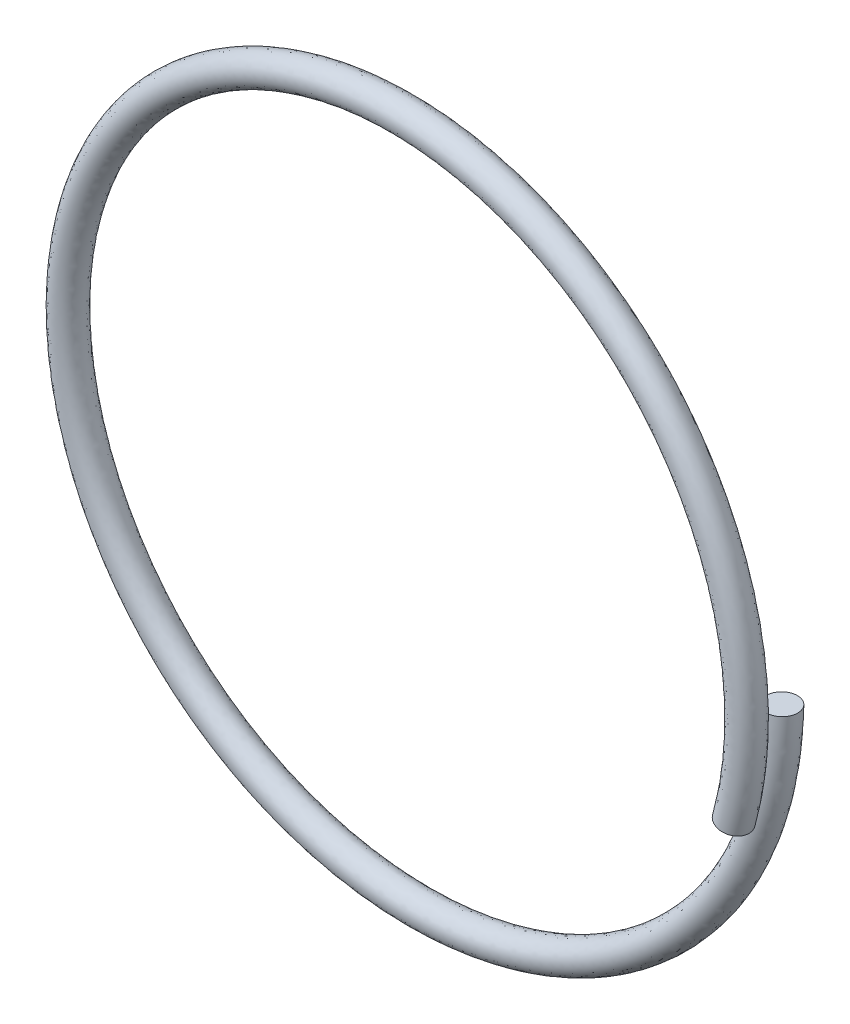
ISO-10303-21;
HEADER;
FILE_DESCRIPTION(('STEP AP214'),'2;1');
FILE_NAME('part.step','',(''),(''),'','','');
FILE_SCHEMA(('AUTOMOTIVE_DESIGN { 1 0 10303 214 1 1 1 1 }'));
ENDSEC;
DATA;
#1=APPLICATION_CONTEXT('core data for automotive mechanical design processes');
#2=APPLICATION_PROTOCOL_DEFINITION('international standard','automotive_design',2000,#1);
#3=PRODUCT_CONTEXT('',#1,'mechanical');
#4=PRODUCT('Part','Part','',(#3));
#5=PRODUCT_RELATED_PRODUCT_CATEGORY('part','',(#4));
#6=PRODUCT_DEFINITION_FORMATION('','',#4);
#7=PRODUCT_DEFINITION_CONTEXT('part definition',#1,'design');
#8=PRODUCT_DEFINITION('design','',#6,#7);
#9=PRODUCT_DEFINITION_SHAPE('','',#8);
#10=(LENGTH_UNIT() NAMED_UNIT(*) SI_UNIT(.MILLI.,.METRE.));
#11=(NAMED_UNIT(*) PLANE_ANGLE_UNIT() SI_UNIT($,.RADIAN.));
#12=(NAMED_UNIT(*) SI_UNIT($,.STERADIAN.) SOLID_ANGLE_UNIT());
#13=UNCERTAINTY_MEASURE_WITH_UNIT(LENGTH_MEASURE(1.E-05),#10,'distance_accuracy_value','');
#14=(GEOMETRIC_REPRESENTATION_CONTEXT(3) GLOBAL_UNCERTAINTY_ASSIGNED_CONTEXT((#13)) GLOBAL_UNIT_ASSIGNED_CONTEXT((#10,
#11,#12)) REPRESENTATION_CONTEXT('',''));
#15=CARTESIAN_POINT('',(0.,0.,0.));
#16=DIRECTION('',(0.,0.,1.));
#17=DIRECTION('',(1.,0.,0.));
#18=AXIS2_PLACEMENT_3D('',#15,#16,#17);
#19=CARTESIAN_POINT('',(7.59634238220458,-1.97941466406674,0.832455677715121));
#20=DIRECTION('',(-0.252121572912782,-0.9675596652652,0.0162174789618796));
#21=DIRECTION('',(0.967686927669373,-0.252154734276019,0.));
#22=AXIS2_PLACEMENT_3D('',#19,#20,#21);
#23=PLANE('',#22);
#24=CARTESIAN_POINT('',(7.59634238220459,-1.97941466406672,0.832455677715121));
#25=DIRECTION('',(-0.25212157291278,-0.967559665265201,0.0162174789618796));
#26=DIRECTION('',(0.967686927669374,-0.252154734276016,0.));
#27=AXIS2_PLACEMENT_3D('',#24,#25,#26);
#28=CIRCLE('',#27,0.349999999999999);
#29=CARTESIAN_POINT('',(7.93503280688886,-2.06766882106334,0.832455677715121));
#30=VERTEX_POINT('',#29);
#31=EDGE_CURVE('E40',#30,#30,#28,.T.);
#32=ORIENTED_EDGE('',*,*,#31,.T.);
#33=EDGE_LOOP('',(#32));
#34=FACE_BOUND('',#33,.T.);
#35=ADVANCED_FACE('F32',(#34),#23,.T.);
#36=CARTESIAN_POINT('',(7.85,0.,0.));
#37=DIRECTION('',(0.,-0.999868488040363,0.0162174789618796));
#38=DIRECTION('',(1.,0.,0.));
#39=AXIS2_PLACEMENT_3D('',#36,#37,#38);
#40=PLANE('',#39);
#41=CARTESIAN_POINT('',(7.85,0.,0.));
#42=DIRECTION('',(0.,-0.999868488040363,0.0162174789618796));
#43=DIRECTION('',(1.,0.,0.));
#44=AXIS2_PLACEMENT_3D('',#41,#42,#43);
#45=CIRCLE('',#44,0.349999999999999);
#46=CARTESIAN_POINT('',(8.19999866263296,1.90033891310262E-05,0.0011848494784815));
#47=VERTEX_POINT('',#46);
#48=EDGE_CURVE('E11',#47,#47,#45,.T.);
#49=ORIENTED_EDGE('',*,*,#48,.F.);
#50=EDGE_LOOP('',(#49));
#51=FACE_BOUND('',#50,.T.);
#52=ADVANCED_FACE('F66',(#51),#40,.F.);
#53=CARTESIAN_POINT('',(7.93503280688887,-2.06766882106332,0.832455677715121));
#54=CARTESIAN_POINT('',(9.12880195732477,2.51362450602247,0.765789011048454));
#55=CARTESIAN_POINT('',(5.75817012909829,5.83810558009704,0.699122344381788));
#56=CARTESIAN_POINT('',(2.38753830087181,9.1625866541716,0.632455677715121));
#57=CARTESIAN_POINT('',(-2.17686267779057,7.90577440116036,0.565789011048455));
#58=CARTESIAN_POINT('',(-6.74126365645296,6.64896214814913,0.499122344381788));
#59=CARTESIAN_POINT('',(-7.93503280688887,2.06766882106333,0.432455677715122));
#60=CARTESIAN_POINT('',(-9.12880195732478,-2.51362450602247,0.365789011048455));
#61=CARTESIAN_POINT('',(-5.7581701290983,-5.83810558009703,0.299122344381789));
#62=CARTESIAN_POINT('',(-2.38753830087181,-9.1625866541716,0.232455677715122));
#63=CARTESIAN_POINT('',(2.17686267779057,-7.90577440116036,0.165789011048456));
#64=CARTESIAN_POINT('',(6.74126365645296,-6.64896214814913,0.099122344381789));
#65=CARTESIAN_POINT('',(7.93503280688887,-2.06766882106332,0.0324556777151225));
#66=CARTESIAN_POINT('',(9.12880195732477,2.51362450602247,-0.034210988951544));
#67=CARTESIAN_POINT('',(5.75817012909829,5.83810558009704,-0.100877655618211));
#68=CARTESIAN_POINT('',(2.38753830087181,9.1625866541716,-0.167544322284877));
#69=CARTESIAN_POINT('',(-2.17686267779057,7.90577440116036,-0.234210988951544));
#70=CARTESIAN_POINT('',(-6.74126365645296,6.64896214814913,-0.30087765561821));
#71=CARTESIAN_POINT('',(-7.93503280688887,2.06766882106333,-0.367544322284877));
#72=CARTESIAN_POINT('',(-9.12880195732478,-2.51362450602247,-0.434210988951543));
#73=CARTESIAN_POINT('',(-5.7581701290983,-5.83810558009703,-0.50087765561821));
#74=CARTESIAN_POINT('',(-2.38753830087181,-9.1625866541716,-0.567544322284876));
#75=CARTESIAN_POINT('',(2.17686267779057,-7.90577440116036,-0.634210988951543));
#76=CARTESIAN_POINT('',(6.74126365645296,-6.64896214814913,-0.700877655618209));
#77=CARTESIAN_POINT('',(7.93503280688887,-2.06766882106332,-0.767544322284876));
#78=CARTESIAN_POINT('',(7.93789532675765,-2.05668341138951,1.53236361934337));
#79=CARTESIAN_POINT('',(9.12532204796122,2.52626259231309,1.46569695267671));
#80=CARTESIAN_POINT('',(5.75008774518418,5.84607729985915,1.39903028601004));
#81=CARTESIAN_POINT('',(2.37485344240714,9.1658920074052,1.33236361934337));
#82=CARTESIAN_POINT('',(-2.18780758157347,7.90276071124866,1.26569695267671));
#83=CARTESIAN_POINT('',(-6.75046860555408,6.63962941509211,1.19903028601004));
#84=CARTESIAN_POINT('',(-7.93789532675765,2.05668341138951,1.13236361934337));
#85=CARTESIAN_POINT('',(-9.12532204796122,-2.52626259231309,1.06569695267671));
#86=CARTESIAN_POINT('',(-5.75008774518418,-5.84607729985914,0.999030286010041));
#87=CARTESIAN_POINT('',(-2.37485344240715,-9.1658920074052,0.932363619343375));
#88=CARTESIAN_POINT('',(2.18780758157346,-7.90276071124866,0.865696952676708));
#89=CARTESIAN_POINT('',(6.75046860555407,-6.63962941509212,0.799030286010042));
#90=CARTESIAN_POINT('',(7.93789532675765,-2.05668341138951,0.732363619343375));
#91=CARTESIAN_POINT('',(9.12532204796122,2.52626259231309,0.665696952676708));
#92=CARTESIAN_POINT('',(5.75008774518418,5.84607729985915,0.599030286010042));
#93=CARTESIAN_POINT('',(2.37485344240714,9.1658920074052,0.532363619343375));
#94=CARTESIAN_POINT('',(-2.18780758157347,7.90276071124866,0.465696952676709));
#95=CARTESIAN_POINT('',(-6.75046860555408,6.63962941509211,0.399030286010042));
#96=CARTESIAN_POINT('',(-7.93789532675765,2.05668341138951,0.332363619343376));
#97=CARTESIAN_POINT('',(-9.12532204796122,-2.52626259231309,0.265696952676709));
#98=CARTESIAN_POINT('',(-5.75008774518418,-5.84607729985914,0.199030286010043));
#99=CARTESIAN_POINT('',(-2.37485344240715,-9.1658920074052,0.132363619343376));
#100=CARTESIAN_POINT('',(2.18780758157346,-7.90276071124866,0.0656969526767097));
#101=CARTESIAN_POINT('',(6.75046860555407,-6.63962941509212,-0.000969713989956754));
#102=CARTESIAN_POINT('',(7.93789532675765,-2.05668341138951,-0.0676363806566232));
#103=CARTESIAN_POINT('',(7.26051447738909,-1.8801750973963,1.53236361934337));
#104=CARTESIAN_POINT('',(8.34603407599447,2.31168489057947,1.46569695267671));
#105=CARTESIAN_POINT('',(5.25853663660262,5.3477024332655,1.39903028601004));
#106=CARTESIAN_POINT('',(2.17103919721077,8.38371997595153,1.33236361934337));
#107=CARTESIAN_POINT('',(-2.00197784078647,7.2278775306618,1.26569695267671));
#108=CARTESIAN_POINT('',(-6.1749948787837,6.07203508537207,1.19903028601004));
#109=CARTESIAN_POINT('',(-7.26051447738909,1.8801750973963,1.13236361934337));
#110=CARTESIAN_POINT('',(-8.34603407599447,-2.31168489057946,1.06569695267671));
#111=CARTESIAN_POINT('',(-5.25853663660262,-5.3477024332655,0.999030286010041));
#112=CARTESIAN_POINT('',(-2.17103919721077,-8.38371997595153,0.932363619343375));
#113=CARTESIAN_POINT('',(2.00197784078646,-7.2278775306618,0.865696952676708));
#114=CARTESIAN_POINT('',(6.1749948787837,-6.07203508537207,0.799030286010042));
#115=CARTESIAN_POINT('',(7.26051447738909,-1.8801750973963,0.732363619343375));
#116=CARTESIAN_POINT('',(8.34603407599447,2.31168489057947,0.665696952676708));
#117=CARTESIAN_POINT('',(5.25853663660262,5.3477024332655,0.599030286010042));
#118=CARTESIAN_POINT('',(2.17103919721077,8.38371997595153,0.532363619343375));
#119=CARTESIAN_POINT('',(-2.00197784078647,7.2278775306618,0.465696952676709));
#120=CARTESIAN_POINT('',(-6.1749948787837,6.07203508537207,0.399030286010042));
#121=CARTESIAN_POINT('',(-7.26051447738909,1.8801750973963,0.332363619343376));
#122=CARTESIAN_POINT('',(-8.34603407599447,-2.31168489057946,0.265696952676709));
#123=CARTESIAN_POINT('',(-5.25853663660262,-5.3477024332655,0.199030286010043));
#124=CARTESIAN_POINT('',(-2.17103919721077,-8.38371997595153,0.132363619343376));
#125=CARTESIAN_POINT('',(2.00197784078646,-7.2278775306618,0.0656969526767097));
#126=CARTESIAN_POINT('',(6.1749948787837,-6.07203508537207,-0.000969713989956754));
#127=CARTESIAN_POINT('',(7.26051447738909,-1.8801750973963,-0.0676363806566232));
#128=CARTESIAN_POINT('',(7.25765195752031,-1.89116050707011,0.832455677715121));
#129=CARTESIAN_POINT('',(8.34951398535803,2.29904680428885,0.765789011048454));
#130=CARTESIAN_POINT('',(5.26661902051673,5.33973071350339,0.699122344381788));
#131=CARTESIAN_POINT('',(2.18372405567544,8.38041462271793,0.632455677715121));
#132=CARTESIAN_POINT('',(-1.99103293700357,7.2308912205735,0.565789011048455));
#133=CARTESIAN_POINT('',(-6.16578992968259,6.08136781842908,0.499122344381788));
#134=CARTESIAN_POINT('',(-7.25765195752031,1.89116050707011,0.432455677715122));
#135=CARTESIAN_POINT('',(-8.34951398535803,-2.29904680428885,0.365789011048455));
#136=CARTESIAN_POINT('',(-5.26661902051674,-5.33973071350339,0.299122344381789));
#137=CARTESIAN_POINT('',(-2.18372405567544,-8.38041462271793,0.232455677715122));
#138=CARTESIAN_POINT('',(1.99103293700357,-7.2308912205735,0.165789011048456));
#139=CARTESIAN_POINT('',(6.16578992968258,-6.08136781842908,0.099122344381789));
#140=CARTESIAN_POINT('',(7.25765195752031,-1.89116050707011,0.0324556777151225));
#141=CARTESIAN_POINT('',(8.34951398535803,2.29904680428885,-0.034210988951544));
#142=CARTESIAN_POINT('',(5.26661902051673,5.33973071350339,-0.100877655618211));
#143=CARTESIAN_POINT('',(2.18372405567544,8.38041462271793,-0.167544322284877));
#144=CARTESIAN_POINT('',(-1.99103293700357,7.2308912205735,-0.234210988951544));
#145=CARTESIAN_POINT('',(-6.16578992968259,6.08136781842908,-0.30087765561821));
#146=CARTESIAN_POINT('',(-7.25765195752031,1.89116050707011,-0.367544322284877));
#147=CARTESIAN_POINT('',(-8.34951398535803,-2.29904680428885,-0.434210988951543));
#148=CARTESIAN_POINT('',(-5.26661902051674,-5.33973071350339,-0.50087765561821));
#149=CARTESIAN_POINT('',(-2.18372405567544,-8.38041462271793,-0.567544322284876));
#150=CARTESIAN_POINT('',(1.99103293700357,-7.2308912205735,-0.634210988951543));
#151=CARTESIAN_POINT('',(6.16578992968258,-6.08136781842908,-0.700877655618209));
#152=CARTESIAN_POINT('',(7.25765195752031,-1.89116050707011,-0.767544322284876));
#153=CARTESIAN_POINT('',(7.25478943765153,-1.90214591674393,0.132547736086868));
#154=CARTESIAN_POINT('',(8.35299389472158,2.28640871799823,0.0658810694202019));
#155=CARTESIAN_POINT('',(5.27470140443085,5.33175899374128,-0.000785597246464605));
#156=CARTESIAN_POINT('',(2.19640891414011,8.37710926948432,-0.0674522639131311));
#157=CARTESIAN_POINT('',(-1.98008803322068,7.23390491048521,-0.134118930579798));
#158=CARTESIAN_POINT('',(-6.15658498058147,6.09070055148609,-0.200785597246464));
#159=CARTESIAN_POINT('',(-7.25478943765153,1.90214591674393,-0.267452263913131));
#160=CARTESIAN_POINT('',(-8.35299389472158,-2.28640871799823,-0.334118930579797));
#161=CARTESIAN_POINT('',(-5.27470140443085,-5.33175899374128,-0.400785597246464));
#162=CARTESIAN_POINT('',(-2.19640891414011,-8.37710926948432,-0.46745226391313));
#163=CARTESIAN_POINT('',(1.98008803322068,-7.23390491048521,-0.534118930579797));
#164=CARTESIAN_POINT('',(6.15658498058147,-6.0907005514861,-0.600785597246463));
#165=CARTESIAN_POINT('',(7.25478943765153,-1.90214591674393,-0.66745226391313));
#166=CARTESIAN_POINT('',(8.35299389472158,2.28640871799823,-0.734118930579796));
#167=CARTESIAN_POINT('',(5.27470140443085,5.33175899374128,-0.800785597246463));
#168=CARTESIAN_POINT('',(2.19640891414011,8.37710926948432,-0.86745226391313));
#169=CARTESIAN_POINT('',(-1.98008803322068,7.23390491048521,-0.934118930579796));
#170=CARTESIAN_POINT('',(-6.15658498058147,6.09070055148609,-1.00078559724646));
#171=CARTESIAN_POINT('',(-7.25478943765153,1.90214591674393,-1.06745226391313));
#172=CARTESIAN_POINT('',(-8.35299389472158,-2.28640871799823,-1.1341189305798));
#173=CARTESIAN_POINT('',(-5.27470140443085,-5.33175899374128,-1.20078559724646));
#174=CARTESIAN_POINT('',(-2.19640891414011,-8.37710926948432,-1.26745226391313));
#175=CARTESIAN_POINT('',(1.98008803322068,-7.23390491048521,-1.3341189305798));
#176=CARTESIAN_POINT('',(6.15658498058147,-6.0907005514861,-1.40078559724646));
#177=CARTESIAN_POINT('',(7.25478943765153,-1.90214591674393,-1.46745226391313));
#178=CARTESIAN_POINT('',(7.93217028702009,-2.07865423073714,0.132547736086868));
#179=CARTESIAN_POINT('',(9.13228186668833,2.50098641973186,0.0658810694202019));
#180=CARTESIAN_POINT('',(5.76625251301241,5.83013386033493,-0.000785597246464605));
#181=CARTESIAN_POINT('',(2.40022315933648,9.159281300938,-0.0674522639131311));
#182=CARTESIAN_POINT('',(-2.16591777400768,7.90878809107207,-0.134118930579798));
#183=CARTESIAN_POINT('',(-6.73205870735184,6.65829488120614,-0.200785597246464));
#184=CARTESIAN_POINT('',(-7.93217028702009,2.07865423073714,-0.267452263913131));
#185=CARTESIAN_POINT('',(-9.13228186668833,-2.50098641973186,-0.334118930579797));
#186=CARTESIAN_POINT('',(-5.76625251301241,-5.83013386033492,-0.400785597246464));
#187=CARTESIAN_POINT('',(-2.40022315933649,-9.159281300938,-0.46745226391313));
#188=CARTESIAN_POINT('',(2.16591777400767,-7.90878809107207,-0.534118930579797));
#189=CARTESIAN_POINT('',(6.73205870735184,-6.65829488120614,-0.600785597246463));
#190=CARTESIAN_POINT('',(7.93217028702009,-2.07865423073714,-0.66745226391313));
#191=CARTESIAN_POINT('',(9.13228186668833,2.50098641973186,-0.734118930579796));
#192=CARTESIAN_POINT('',(5.76625251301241,5.83013386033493,-0.800785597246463));
#193=CARTESIAN_POINT('',(2.40022315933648,9.159281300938,-0.86745226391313));
#194=CARTESIAN_POINT('',(-2.16591777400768,7.90878809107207,-0.934118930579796));
#195=CARTESIAN_POINT('',(-6.73205870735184,6.65829488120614,-1.00078559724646));
#196=CARTESIAN_POINT('',(-7.93217028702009,2.07865423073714,-1.06745226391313));
#197=CARTESIAN_POINT('',(-9.13228186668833,-2.50098641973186,-1.1341189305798));
#198=CARTESIAN_POINT('',(-5.76625251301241,-5.83013386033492,-1.20078559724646));
#199=CARTESIAN_POINT('',(-2.40022315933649,-9.159281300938,-1.26745226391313));
#200=CARTESIAN_POINT('',(2.16591777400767,-7.90878809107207,-1.3341189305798));
#201=CARTESIAN_POINT('',(6.73205870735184,-6.65829488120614,-1.40078559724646));
#202=CARTESIAN_POINT('',(7.93217028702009,-2.07865423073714,-1.46745226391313));
#203=CARTESIAN_POINT('',(7.93503280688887,-2.06766882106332,0.832455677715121));
#204=CARTESIAN_POINT('',(9.12880195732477,2.51362450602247,0.765789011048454));
#205=CARTESIAN_POINT('',(5.75817012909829,5.83810558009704,0.699122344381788));
#206=CARTESIAN_POINT('',(2.38753830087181,9.1625866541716,0.632455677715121));
#207=CARTESIAN_POINT('',(-2.17686267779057,7.90577440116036,0.565789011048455));
#208=CARTESIAN_POINT('',(-6.74126365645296,6.64896214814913,0.499122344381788));
#209=CARTESIAN_POINT('',(-7.93503280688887,2.06766882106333,0.432455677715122));
#210=CARTESIAN_POINT('',(-9.12880195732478,-2.51362450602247,0.365789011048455));
#211=CARTESIAN_POINT('',(-5.7581701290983,-5.83810558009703,0.299122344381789));
#212=CARTESIAN_POINT('',(-2.38753830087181,-9.1625866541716,0.232455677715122));
#213=CARTESIAN_POINT('',(2.17686267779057,-7.90577440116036,0.165789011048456));
#214=CARTESIAN_POINT('',(6.74126365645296,-6.64896214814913,0.099122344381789));
#215=CARTESIAN_POINT('',(7.93503280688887,-2.06766882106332,0.0324556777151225));
#216=CARTESIAN_POINT('',(9.12880195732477,2.51362450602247,-0.034210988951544));
#217=CARTESIAN_POINT('',(5.75817012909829,5.83810558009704,-0.100877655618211));
#218=CARTESIAN_POINT('',(2.38753830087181,9.1625866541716,-0.167544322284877));
#219=CARTESIAN_POINT('',(-2.17686267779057,7.90577440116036,-0.234210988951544));
#220=CARTESIAN_POINT('',(-6.74126365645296,6.64896214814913,-0.30087765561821));
#221=CARTESIAN_POINT('',(-7.93503280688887,2.06766882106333,-0.367544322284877));
#222=CARTESIAN_POINT('',(-9.12880195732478,-2.51362450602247,-0.434210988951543));
#223=CARTESIAN_POINT('',(-5.7581701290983,-5.83810558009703,-0.50087765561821));
#224=CARTESIAN_POINT('',(-2.38753830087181,-9.1625866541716,-0.567544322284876));
#225=CARTESIAN_POINT('',(2.17686267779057,-7.90577440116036,-0.634210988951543));
#226=CARTESIAN_POINT('',(6.74126365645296,-6.64896214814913,-0.700877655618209));
#227=CARTESIAN_POINT('',(7.93503280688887,-2.06766882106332,-0.767544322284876));
#228=(BOUNDED_SURFACE() B_SPLINE_SURFACE(3,2,((#53,#54,#55,#56,#57,#58,#59,#60,#61,#62,#63,#64,
#65,#66,#67,#68,#69,#70,#71,#72,#73,#74,#75,#76,#77),(#78,#79,#80,#81,#82,#83,#84,#85,#86,#87,
#88,#89,#90,#91,#92,#93,#94,#95,#96,#97,#98,#99,#100,#101,#102),(#103,#104,#105,#106,#107,#108,
#109,#110,#111,#112,#113,#114,#115,#116,#117,#118,#119,#120,#121,#122,#123,#124,#125,#126,#127),
(#128,#129,#130,#131,#132,#133,#134,#135,#136,#137,#138,#139,#140,#141,#142,#143,#144,#145,#146,
#147,#148,#149,#150,#151,#152),(#153,#154,#155,#156,#157,#158,#159,#160,#161,#162,#163,#164,
#165,#166,#167,#168,#169,#170,#171,#172,#173,#174,#175,#176,#177),(#178,#179,#180,#181,#182,
#183,#184,#185,#186,#187,#188,#189,#190,#191,#192,#193,#194,#195,#196,#197,#198,#199,#200,#201,
#202),(#203,#204,#205,#206,#207,#208,#209,#210,#211,#212,#213,#214,#215,#216,#217,#218,#219,
#220,#221,#222,#223,#224,#225,#226,#227)),.UNSPECIFIED.,.T.,.F.,
.F.) B_SPLINE_SURFACE_WITH_KNOTS((4,3,4),(3,2,2,2,2,2,2,2,2,2,2,2,3),(0.,0.5,1.),(0.,
0.0833333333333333,0.166666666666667,0.25,0.333333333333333,0.416666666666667,0.5,
0.583333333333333,0.666666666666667,0.75,0.833333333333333,0.916666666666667,1.),
.UNSPECIFIED.) GEOMETRIC_REPRESENTATION_ITEM() RATIONAL_B_SPLINE_SURFACE(((1.,0.866025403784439,
1.,0.866025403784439,1.,0.866025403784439,1.,0.866025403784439,1.,0.866025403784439,1.,
0.866025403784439,1.,0.866025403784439,1.,0.866025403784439,1.,0.866025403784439,1.,
0.866025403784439,1.,0.866025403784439,1.,0.866025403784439,1.),(0.333333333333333,
0.288675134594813,0.333333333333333,0.288675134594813,0.333333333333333,0.288675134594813,
0.333333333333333,0.288675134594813,0.333333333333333,0.288675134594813,0.333333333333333,
0.288675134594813,0.333333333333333,0.288675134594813,0.333333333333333,0.288675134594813,
0.333333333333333,0.288675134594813,0.333333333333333,0.288675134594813,0.333333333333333,
0.288675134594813,0.333333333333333,0.288675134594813,0.333333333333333),(0.333333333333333,
0.288675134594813,0.333333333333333,0.288675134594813,0.333333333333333,0.288675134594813,
0.333333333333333,0.288675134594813,0.333333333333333,0.288675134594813,0.333333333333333,
0.288675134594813,0.333333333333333,0.288675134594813,0.333333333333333,0.288675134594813,
0.333333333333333,0.288675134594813,0.333333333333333,0.288675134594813,0.333333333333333,
0.288675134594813,0.333333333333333,0.288675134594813,0.333333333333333),(1.,0.866025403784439,
1.,0.866025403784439,1.,0.866025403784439,1.,0.866025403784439,1.,0.866025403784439,1.,
0.866025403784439,1.,0.866025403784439,1.,0.866025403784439,1.,0.866025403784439,1.,
0.866025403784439,1.,0.866025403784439,1.,0.866025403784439,1.),(0.333333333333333,
0.288675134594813,0.333333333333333,0.288675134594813,0.333333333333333,0.288675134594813,
0.333333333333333,0.288675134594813,0.333333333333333,0.288675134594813,0.333333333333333,
0.288675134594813,0.333333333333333,0.288675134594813,0.333333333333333,0.288675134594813,
0.333333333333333,0.288675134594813,0.333333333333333,0.288675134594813,0.333333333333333,
0.288675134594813,0.333333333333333,0.288675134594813,0.333333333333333),(0.333333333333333,
0.288675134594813,0.333333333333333,0.288675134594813,0.333333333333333,0.288675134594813,
0.333333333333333,0.288675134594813,0.333333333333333,0.288675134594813,0.333333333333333,
0.288675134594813,0.333333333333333,0.288675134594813,0.333333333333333,0.288675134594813,
0.333333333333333,0.288675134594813,0.333333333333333,0.288675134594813,0.333333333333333,
0.288675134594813,0.333333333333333,0.288675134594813,0.333333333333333),(1.,0.866025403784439,
1.,0.866025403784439,1.,0.866025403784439,1.,0.866025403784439,1.,0.866025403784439,1.,
0.866025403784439,1.,0.866025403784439,1.,0.866025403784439,1.,0.866025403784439,1.,
0.866025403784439,1.,0.866025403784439,1.,0.866025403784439,1.))) REPRESENTATION_ITEM('') SURFACE());
#229=ORIENTED_EDGE('',*,*,#48,.T.);
#230=EDGE_LOOP('',(#229));
#231=FACE_BOUND('',#230,.T.);
#232=ORIENTED_EDGE('',*,*,#31,.F.);
#233=EDGE_LOOP('',(#232));
#234=FACE_BOUND('',#233,.T.);
#235=ADVANCED_FACE('F48',(#231,#234),#228,.F.);
#236=CLOSED_SHELL('',(#35,#52,#235));
#237=MANIFOLD_SOLID_BREP('B2',#236);
#238=ADVANCED_BREP_SHAPE_REPRESENTATION('',(#18,#237),#14);
#239=SHAPE_DEFINITION_REPRESENTATION(#9,#238);
ENDSEC;
END-ISO-10303-21;
